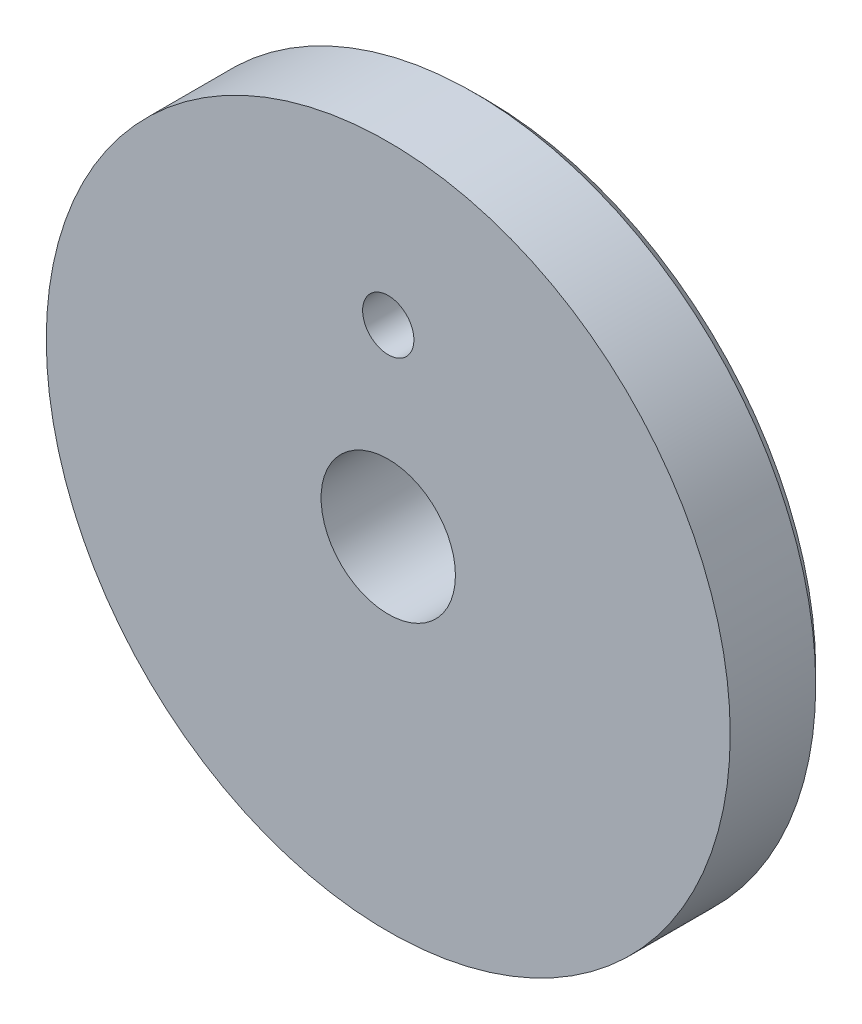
ISO-10303-21;
HEADER;
FILE_DESCRIPTION(('STEP AP214'),'2;1');
FILE_NAME('part.step','',(''),(''),'','','');
FILE_SCHEMA(('AUTOMOTIVE_DESIGN { 1 0 10303 214 1 1 1 1 }'));
ENDSEC;
DATA;
#1=APPLICATION_CONTEXT('core data for automotive mechanical design processes');
#2=APPLICATION_PROTOCOL_DEFINITION('international standard','automotive_design',2000,#1);
#3=PRODUCT_CONTEXT('',#1,'mechanical');
#4=PRODUCT('Part','Part','',(#3));
#5=PRODUCT_RELATED_PRODUCT_CATEGORY('part','',(#4));
#6=PRODUCT_DEFINITION_FORMATION('','',#4);
#7=PRODUCT_DEFINITION_CONTEXT('part definition',#1,'design');
#8=PRODUCT_DEFINITION('design','',#6,#7);
#9=PRODUCT_DEFINITION_SHAPE('','',#8);
#10=(LENGTH_UNIT() NAMED_UNIT(*) SI_UNIT(.MILLI.,.METRE.));
#11=(NAMED_UNIT(*) PLANE_ANGLE_UNIT() SI_UNIT($,.RADIAN.));
#12=(NAMED_UNIT(*) SI_UNIT($,.STERADIAN.) SOLID_ANGLE_UNIT());
#13=UNCERTAINTY_MEASURE_WITH_UNIT(LENGTH_MEASURE(1.E-05),#10,'distance_accuracy_value','');
#14=(GEOMETRIC_REPRESENTATION_CONTEXT(3) GLOBAL_UNCERTAINTY_ASSIGNED_CONTEXT((#13)) GLOBAL_UNIT_ASSIGNED_CONTEXT((#10,
#11,#12)) REPRESENTATION_CONTEXT('',''));
#15=CARTESIAN_POINT('',(0.,0.,0.));
#16=DIRECTION('',(0.,0.,1.));
#17=DIRECTION('',(1.,0.,0.));
#18=AXIS2_PLACEMENT_3D('',#15,#16,#17);
#19=CARTESIAN_POINT('',(0.,0.,-4.));
#20=DIRECTION('',(0.,0.,1.));
#21=DIRECTION('',(1.,0.,0.));
#22=AXIS2_PLACEMENT_3D('',#19,#20,#21);
#23=CYLINDRICAL_SURFACE('',#22,14.);
#24=CARTESIAN_POINT('',(0.,0.,-3.49999999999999));
#25=DIRECTION('',(0.,0.,1.));
#26=DIRECTION('',(1.,0.,0.));
#27=AXIS2_PLACEMENT_3D('',#24,#25,#26);
#28=CIRCLE('',#27,14.);
#29=CARTESIAN_POINT('',(14.,0.,-3.49999999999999));
#30=VERTEX_POINT('',#29);
#31=EDGE_CURVE('E44',#30,#30,#28,.T.);
#32=ORIENTED_EDGE('',*,*,#31,.T.);
#33=EDGE_LOOP('',(#32));
#34=FACE_BOUND('',#33,.T.);
#35=CARTESIAN_POINT('',(0.,0.,0.));
#36=DIRECTION('',(0.,0.,1.));
#37=DIRECTION('',(1.,0.,0.));
#38=AXIS2_PLACEMENT_3D('',#35,#36,#37);
#39=CIRCLE('',#38,14.);
#40=CARTESIAN_POINT('',(14.,0.,0.));
#41=VERTEX_POINT('',#40);
#42=EDGE_CURVE('E48',#41,#41,#39,.T.);
#43=ORIENTED_EDGE('',*,*,#42,.F.);
#44=EDGE_LOOP('',(#43));
#45=FACE_BOUND('',#44,.T.);
#46=ADVANCED_FACE('F37',(#34,#45),#23,.T.);
#47=CARTESIAN_POINT('',(0.,0.,-4.));
#48=DIRECTION('',(0.,0.,1.));
#49=DIRECTION('',(1.,0.,0.));
#50=AXIS2_PLACEMENT_3D('',#47,#48,#49);
#51=PLANE('',#50);
#52=CARTESIAN_POINT('',(0.,0.,-4.));
#53=DIRECTION('',(0.,0.,1.));
#54=DIRECTION('',(1.,0.,0.));
#55=AXIS2_PLACEMENT_3D('',#52,#53,#54);
#56=CIRCLE('',#55,13.5);
#57=CARTESIAN_POINT('',(13.5,0.,-4.));
#58=VERTEX_POINT('',#57);
#59=EDGE_CURVE('E10',#58,#58,#56,.F.);
#60=ORIENTED_EDGE('',*,*,#59,.T.);
#61=EDGE_LOOP('',(#60));
#62=FACE_BOUND('',#61,.T.);
#63=CARTESIAN_POINT('',(0.,7.5,-3.99999999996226));
#64=DIRECTION('',(0.,0.,-1.));
#65=DIRECTION('',(-1.,0.,0.));
#66=AXIS2_PLACEMENT_3D('',#63,#64,#65);
#67=CIRCLE('',#66,1.05);
#68=CARTESIAN_POINT('',(-1.05,7.5,-3.99999999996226));
#69=VERTEX_POINT('',#68);
#70=EDGE_CURVE('E61',#69,#69,#67,.T.);
#71=ORIENTED_EDGE('',*,*,#70,.F.);
#72=EDGE_LOOP('',(#71));
#73=FACE_BOUND('',#72,.T.);
#74=CARTESIAN_POINT('',(0.,0.,-4.));
#75=DIRECTION('',(0.,0.,1.));
#76=DIRECTION('',(1.,0.,0.));
#77=AXIS2_PLACEMENT_3D('',#74,#75,#76);
#78=CIRCLE('',#77,2.75);
#79=CARTESIAN_POINT('',(2.75,0.,-4.));
#80=VERTEX_POINT('',#79);
#81=EDGE_CURVE('E52',#80,#80,#78,.T.);
#82=ORIENTED_EDGE('',*,*,#81,.T.);
#83=EDGE_LOOP('',(#82));
#84=FACE_BOUND('',#83,.T.);
#85=ADVANCED_FACE('F77',(#62,#73,#84),#51,.F.);
#86=CARTESIAN_POINT('',(0.,0.,0.));
#87=DIRECTION('',(0.,0.,1.));
#88=DIRECTION('',(1.,0.,0.));
#89=AXIS2_PLACEMENT_3D('',#86,#87,#88);
#90=PLANE('',#89);
#91=CARTESIAN_POINT('',(0.,7.5,0.));
#92=DIRECTION('',(0.,0.,-1.));
#93=DIRECTION('',(-1.,0.,0.));
#94=AXIS2_PLACEMENT_3D('',#91,#92,#93);
#95=CIRCLE('',#94,1.05);
#96=CARTESIAN_POINT('',(-1.05,7.5,0.));
#97=VERTEX_POINT('',#96);
#98=EDGE_CURVE('E58',#97,#97,#95,.T.);
#99=ORIENTED_EDGE('',*,*,#98,.T.);
#100=EDGE_LOOP('',(#99));
#101=FACE_BOUND('',#100,.T.);
#102=CARTESIAN_POINT('',(0.,0.,0.));
#103=DIRECTION('',(0.,0.,1.));
#104=DIRECTION('',(1.,0.,0.));
#105=AXIS2_PLACEMENT_3D('',#102,#103,#104);
#106=CIRCLE('',#105,2.75);
#107=CARTESIAN_POINT('',(2.75,0.,0.));
#108=VERTEX_POINT('',#107);
#109=EDGE_CURVE('E55',#108,#108,#106,.T.);
#110=ORIENTED_EDGE('',*,*,#109,.F.);
#111=EDGE_LOOP('',(#110));
#112=FACE_BOUND('',#111,.T.);
#113=ORIENTED_EDGE('',*,*,#42,.T.);
#114=EDGE_LOOP('',(#113));
#115=FACE_BOUND('',#114,.T.);
#116=ADVANCED_FACE('F67',(#101,#112,#115),#90,.T.);
#117=CARTESIAN_POINT('',(0.,0.,-4.));
#118=DIRECTION('',(0.,0.,1.));
#119=DIRECTION('',(1.,0.,0.));
#120=AXIS2_PLACEMENT_3D('',#117,#118,#119);
#121=CYLINDRICAL_SURFACE('',#120,2.75);
#122=ORIENTED_EDGE('',*,*,#81,.F.);
#123=EDGE_LOOP('',(#122));
#124=FACE_BOUND('',#123,.T.);
#125=ORIENTED_EDGE('',*,*,#109,.T.);
#126=EDGE_LOOP('',(#125));
#127=FACE_BOUND('',#126,.T.);
#128=ADVANCED_FACE('F73',(#124,#127),#121,.F.);
#129=CARTESIAN_POINT('',(0.,7.5,0.));
#130=DIRECTION('',(0.,0.,-1.));
#131=DIRECTION('',(-1.,0.,0.));
#132=AXIS2_PLACEMENT_3D('',#129,#130,#131);
#133=CYLINDRICAL_SURFACE('',#132,1.05);
#134=ORIENTED_EDGE('',*,*,#98,.F.);
#135=EDGE_LOOP('',(#134));
#136=FACE_BOUND('',#135,.T.);
#137=ORIENTED_EDGE('',*,*,#70,.T.);
#138=EDGE_LOOP('',(#137));
#139=FACE_BOUND('',#138,.T.);
#140=ADVANCED_FACE('F70',(#136,#139),#133,.F.);
#141=CARTESIAN_POINT('',(0.,0.,-3.49999999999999));
#142=DIRECTION('',(0.,0.,1.));
#143=DIRECTION('',(1.,0.,0.));
#144=AXIS2_PLACEMENT_3D('',#141,#142,#143);
#145=CONICAL_SURFACE('',#144,14.,0.785398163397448);
#146=ORIENTED_EDGE('',*,*,#59,.F.);
#147=EDGE_LOOP('',(#146));
#148=FACE_BOUND('',#147,.T.);
#149=ORIENTED_EDGE('',*,*,#31,.F.);
#150=EDGE_LOOP('',(#149));
#151=FACE_BOUND('',#150,.T.);
#152=ADVANCED_FACE('F39',(#148,#151),#145,.T.);
#153=CLOSED_SHELL('',(#46,#85,#116,#128,#140,#152));
#154=MANIFOLD_SOLID_BREP('B2',#153);
#155=ADVANCED_BREP_SHAPE_REPRESENTATION('',(#18,#154),#14);
#156=SHAPE_DEFINITION_REPRESENTATION(#9,#155);
ENDSEC;
END-ISO-10303-21;
